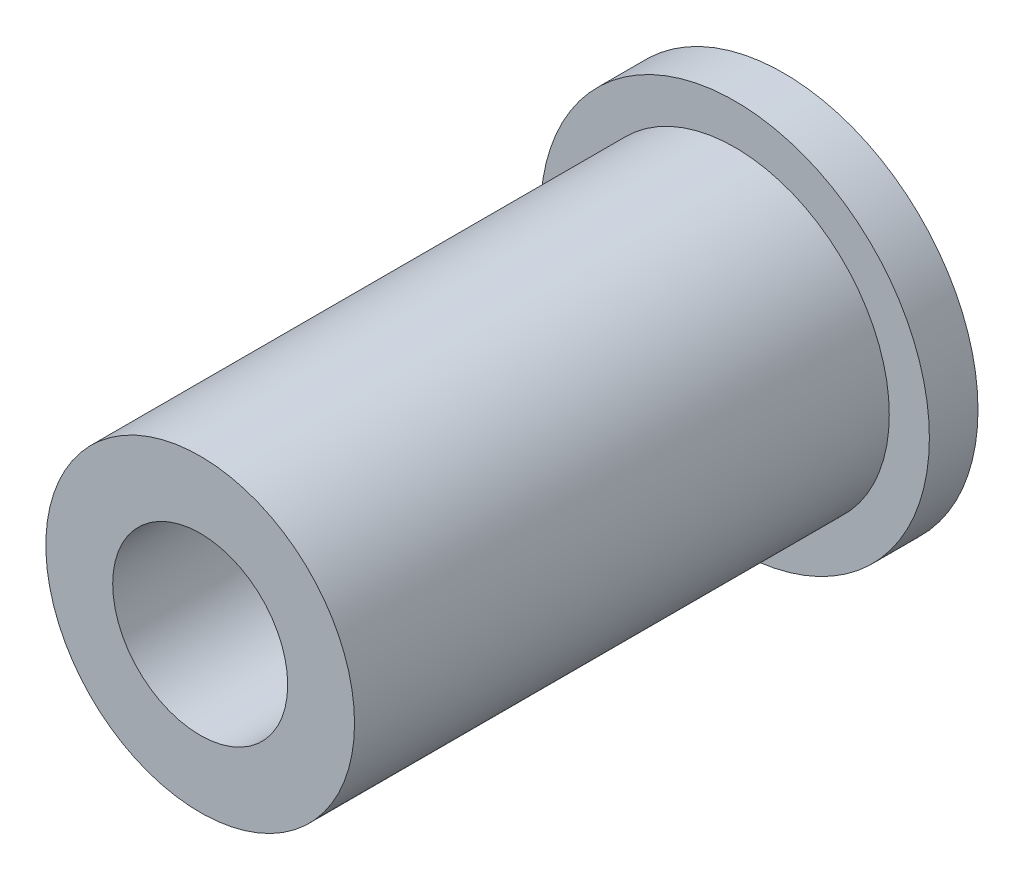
ISO-10303-21;
HEADER;
FILE_DESCRIPTION(('STEP AP214'),'2;1');
FILE_NAME('part.step','',(''),(''),'','','');
FILE_SCHEMA(('AUTOMOTIVE_DESIGN { 1 0 10303 214 1 1 1 1 }'));
ENDSEC;
DATA;
#1=APPLICATION_CONTEXT('core data for automotive mechanical design processes');
#2=APPLICATION_PROTOCOL_DEFINITION('international standard','automotive_design',2000,#1);
#3=PRODUCT_CONTEXT('',#1,'mechanical');
#4=PRODUCT('Part','Part','',(#3));
#5=PRODUCT_RELATED_PRODUCT_CATEGORY('part','',(#4));
#6=PRODUCT_DEFINITION_FORMATION('','',#4);
#7=PRODUCT_DEFINITION_CONTEXT('part definition',#1,'design');
#8=PRODUCT_DEFINITION('design','',#6,#7);
#9=PRODUCT_DEFINITION_SHAPE('','',#8);
#10=(LENGTH_UNIT() NAMED_UNIT(*) SI_UNIT(.MILLI.,.METRE.));
#11=(NAMED_UNIT(*) PLANE_ANGLE_UNIT() SI_UNIT($,.RADIAN.));
#12=(NAMED_UNIT(*) SI_UNIT($,.STERADIAN.) SOLID_ANGLE_UNIT());
#13=UNCERTAINTY_MEASURE_WITH_UNIT(LENGTH_MEASURE(1.E-05),#10,'distance_accuracy_value','');
#14=(GEOMETRIC_REPRESENTATION_CONTEXT(3) GLOBAL_UNCERTAINTY_ASSIGNED_CONTEXT((#13)) GLOBAL_UNIT_ASSIGNED_CONTEXT((#10,
#11,#12)) REPRESENTATION_CONTEXT('',''));
#15=CARTESIAN_POINT('',(0.,0.,0.));
#16=DIRECTION('',(0.,0.,1.));
#17=DIRECTION('',(1.,0.,0.));
#18=AXIS2_PLACEMENT_3D('',#15,#16,#17);
#19=CARTESIAN_POINT('',(0.,0.,4.5));
#20=DIRECTION('',(0.,0.,-1.));
#21=DIRECTION('',(-1.,0.,0.));
#22=AXIS2_PLACEMENT_3D('',#19,#20,#21);
#23=CYLINDRICAL_SURFACE('',#22,2.8);
#24=CARTESIAN_POINT('',(0.,0.,0.));
#25=DIRECTION('',(0.,0.,-1.));
#26=DIRECTION('',(-1.,0.,0.));
#27=AXIS2_PLACEMENT_3D('',#24,#25,#26);
#28=CIRCLE('',#27,2.8);
#29=CARTESIAN_POINT('',(-2.8,0.,0.));
#30=VERTEX_POINT('',#29);
#31=EDGE_CURVE('E18',#30,#30,#28,.T.);
#32=ORIENTED_EDGE('',*,*,#31,.T.);
#33=EDGE_LOOP('',(#32));
#34=FACE_BOUND('',#33,.T.);
#35=CARTESIAN_POINT('',(0.,0.,4.5));
#36=DIRECTION('',(0.,0.,-1.));
#37=DIRECTION('',(-1.,0.,0.));
#38=AXIS2_PLACEMENT_3D('',#35,#36,#37);
#39=CIRCLE('',#38,2.8);
#40=CARTESIAN_POINT('',(-2.8,0.,4.5));
#41=VERTEX_POINT('',#40);
#42=EDGE_CURVE('E40',#41,#41,#39,.T.);
#43=ORIENTED_EDGE('',*,*,#42,.F.);
#44=EDGE_LOOP('',(#43));
#45=FACE_BOUND('',#44,.T.);
#46=ADVANCED_FACE('F15',(#34,#45),#23,.F.);
#47=CARTESIAN_POINT('',(0.,0.,0.));
#48=DIRECTION('',(0.,0.,1.));
#49=DIRECTION('',(1.,0.,0.));
#50=AXIS2_PLACEMENT_3D('',#47,#48,#49);
#51=PLANE('',#50);
#52=CARTESIAN_POINT('',(0.,0.,0.));
#53=DIRECTION('',(0.,0.,-1.));
#54=DIRECTION('',(-1.,0.,0.));
#55=AXIS2_PLACEMENT_3D('',#52,#53,#54);
#56=CIRCLE('',#55,4.);
#57=CARTESIAN_POINT('',(-4.,0.,0.));
#58=VERTEX_POINT('',#57);
#59=EDGE_CURVE('E38',#58,#58,#56,.F.);
#60=ORIENTED_EDGE('',*,*,#59,.F.);
#61=EDGE_LOOP('',(#60));
#62=FACE_BOUND('',#61,.T.);
#63=ORIENTED_EDGE('',*,*,#31,.F.);
#64=EDGE_LOOP('',(#63));
#65=FACE_BOUND('',#64,.T.);
#66=ADVANCED_FACE('F49',(#62,#65),#51,.F.);
#67=CARTESIAN_POINT('',(0.,0.,4.5));
#68=DIRECTION('',(0.,0.,-1.));
#69=DIRECTION('',(-1.,0.,0.));
#70=AXIS2_PLACEMENT_3D('',#67,#68,#69);
#71=PLANE('',#70);
#72=CARTESIAN_POINT('',(0.,0.,4.5));
#73=DIRECTION('',(0.,0.,-1.));
#74=DIRECTION('',(-1.,0.,0.));
#75=AXIS2_PLACEMENT_3D('',#72,#73,#74);
#76=CIRCLE('',#75,1.8);
#77=CARTESIAN_POINT('',(-1.8,0.,4.5));
#78=VERTEX_POINT('',#77);
#79=EDGE_CURVE('E35',#78,#78,#76,.F.);
#80=ORIENTED_EDGE('',*,*,#79,.T.);
#81=EDGE_LOOP('',(#80));
#82=FACE_BOUND('',#81,.T.);
#83=ORIENTED_EDGE('',*,*,#42,.T.);
#84=EDGE_LOOP('',(#83));
#85=FACE_BOUND('',#84,.T.);
#86=ADVANCED_FACE('F51',(#82,#85),#71,.T.);
#87=CARTESIAN_POINT('',(0.,0.,12.));
#88=DIRECTION('',(0.,0.,-1.));
#89=DIRECTION('',(-1.,0.,0.));
#90=AXIS2_PLACEMENT_3D('',#87,#88,#89);
#91=CYLINDRICAL_SURFACE('',#90,4.);
#92=ORIENTED_EDGE('',*,*,#59,.T.);
#93=EDGE_LOOP('',(#92));
#94=FACE_BOUND('',#93,.T.);
#95=CARTESIAN_POINT('',(0.,0.,1.));
#96=DIRECTION('',(0.,0.,-1.));
#97=DIRECTION('',(-1.,0.,0.));
#98=AXIS2_PLACEMENT_3D('',#95,#96,#97);
#99=CIRCLE('',#98,4.);
#100=CARTESIAN_POINT('',(-4.,0.,1.));
#101=VERTEX_POINT('',#100);
#102=EDGE_CURVE('E32',#101,#101,#99,.F.);
#103=ORIENTED_EDGE('',*,*,#102,.F.);
#104=EDGE_LOOP('',(#103));
#105=FACE_BOUND('',#104,.T.);
#106=ADVANCED_FACE('F58',(#94,#105),#91,.T.);
#107=CARTESIAN_POINT('',(0.,0.,12.));
#108=DIRECTION('',(0.,0.,-1.));
#109=DIRECTION('',(-1.,0.,0.));
#110=AXIS2_PLACEMENT_3D('',#107,#108,#109);
#111=CYLINDRICAL_SURFACE('',#110,1.8);
#112=ORIENTED_EDGE('',*,*,#79,.F.);
#113=EDGE_LOOP('',(#112));
#114=FACE_BOUND('',#113,.T.);
#115=CARTESIAN_POINT('',(0.,0.,12.));
#116=DIRECTION('',(0.,0.,-1.));
#117=DIRECTION('',(-1.,0.,0.));
#118=AXIS2_PLACEMENT_3D('',#115,#116,#117);
#119=CIRCLE('',#118,1.8);
#120=CARTESIAN_POINT('',(-1.8,0.,12.));
#121=VERTEX_POINT('',#120);
#122=EDGE_CURVE('E27',#121,#121,#119,.T.);
#123=ORIENTED_EDGE('',*,*,#122,.F.);
#124=EDGE_LOOP('',(#123));
#125=FACE_BOUND('',#124,.T.);
#126=ADVANCED_FACE('F76',(#114,#125),#111,.F.);
#127=CARTESIAN_POINT('',(0.,0.,1.));
#128=DIRECTION('',(0.,0.,1.));
#129=DIRECTION('',(1.,0.,0.));
#130=AXIS2_PLACEMENT_3D('',#127,#128,#129);
#131=PLANE('',#130);
#132=ORIENTED_EDGE('',*,*,#102,.T.);
#133=EDGE_LOOP('',(#132));
#134=FACE_BOUND('',#133,.T.);
#135=CARTESIAN_POINT('',(0.,0.,1.));
#136=DIRECTION('',(0.,0.,1.));
#137=DIRECTION('',(1.,0.,0.));
#138=AXIS2_PLACEMENT_3D('',#135,#136,#137);
#139=CIRCLE('',#138,3.175);
#140=CARTESIAN_POINT('',(3.175,0.,1.));
#141=VERTEX_POINT('',#140);
#142=EDGE_CURVE('E22',#141,#141,#139,.T.);
#143=ORIENTED_EDGE('',*,*,#142,.F.);
#144=EDGE_LOOP('',(#143));
#145=FACE_BOUND('',#144,.T.);
#146=ADVANCED_FACE('F69',(#134,#145),#131,.T.);
#147=CARTESIAN_POINT('',(0.,0.,12.));
#148=DIRECTION('',(0.,0.,1.));
#149=DIRECTION('',(1.,0.,0.));
#150=AXIS2_PLACEMENT_3D('',#147,#148,#149);
#151=PLANE('',#150);
#152=CARTESIAN_POINT('',(0.,0.,12.));
#153=DIRECTION('',(0.,0.,1.));
#154=DIRECTION('',(1.,0.,0.));
#155=AXIS2_PLACEMENT_3D('',#152,#153,#154);
#156=CIRCLE('',#155,3.175);
#157=CARTESIAN_POINT('',(3.175,0.,12.));
#158=VERTEX_POINT('',#157);
#159=EDGE_CURVE('E10',#158,#158,#156,.F.);
#160=ORIENTED_EDGE('',*,*,#159,.F.);
#161=EDGE_LOOP('',(#160));
#162=FACE_BOUND('',#161,.T.);
#163=ORIENTED_EDGE('',*,*,#122,.T.);
#164=EDGE_LOOP('',(#163));
#165=FACE_BOUND('',#164,.T.);
#166=ADVANCED_FACE('F64',(#162,#165),#151,.T.);
#167=CARTESIAN_POINT('',(0.,0.,1.));
#168=DIRECTION('',(0.,0.,1.));
#169=DIRECTION('',(1.,0.,0.));
#170=AXIS2_PLACEMENT_3D('',#167,#168,#169);
#171=CYLINDRICAL_SURFACE('',#170,3.175);
#172=ORIENTED_EDGE('',*,*,#159,.T.);
#173=EDGE_LOOP('',(#172));
#174=FACE_BOUND('',#173,.T.);
#175=ORIENTED_EDGE('',*,*,#142,.T.);
#176=EDGE_LOOP('',(#175));
#177=FACE_BOUND('',#176,.T.);
#178=ADVANCED_FACE('F62',(#174,#177),#171,.T.);
#179=CLOSED_SHELL('',(#46,#66,#86,#106,#126,#146,#166,#178));
#180=MANIFOLD_SOLID_BREP('B1',#179);
#181=ADVANCED_BREP_SHAPE_REPRESENTATION('',(#18,#180),#14);
#182=SHAPE_DEFINITION_REPRESENTATION(#9,#181);
ENDSEC;
END-ISO-10303-21;
